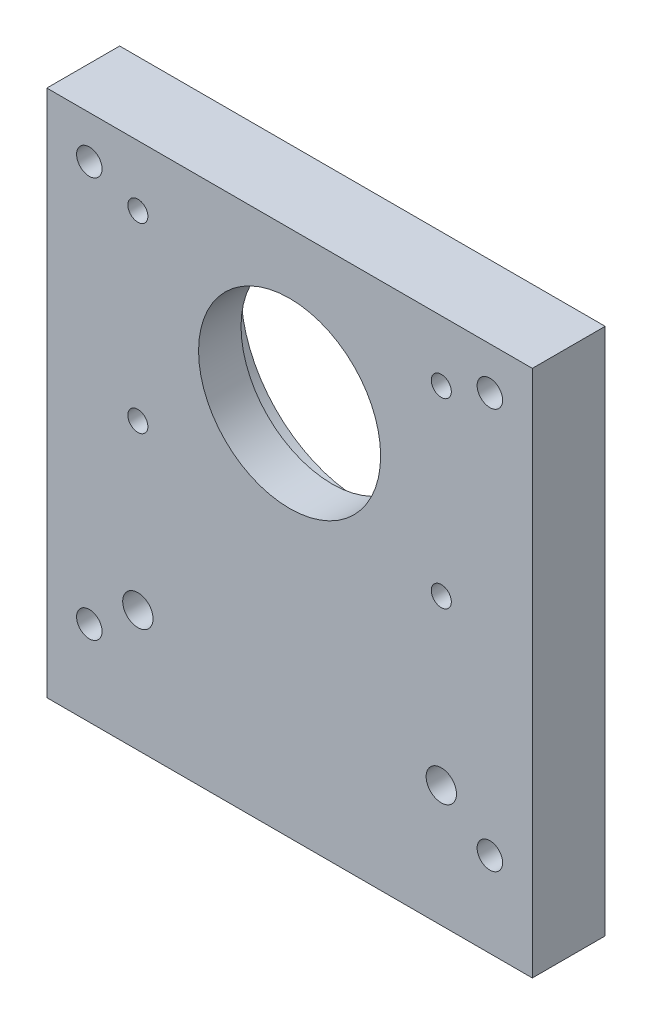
ISO-10303-21;
HEADER;
FILE_DESCRIPTION(('STEP AP214'),'2;1');
FILE_NAME('part.step','',(''),(''),'','','');
FILE_SCHEMA(('AUTOMOTIVE_DESIGN { 1 0 10303 214 1 1 1 1 }'));
ENDSEC;
DATA;
#1=APPLICATION_CONTEXT('core data for automotive mechanical design processes');
#2=APPLICATION_PROTOCOL_DEFINITION('international standard','automotive_design',2000,#1);
#3=PRODUCT_CONTEXT('',#1,'mechanical');
#4=PRODUCT('Part','Part','',(#3));
#5=PRODUCT_RELATED_PRODUCT_CATEGORY('part','',(#4));
#6=PRODUCT_DEFINITION_FORMATION('','',#4);
#7=PRODUCT_DEFINITION_CONTEXT('part definition',#1,'design');
#8=PRODUCT_DEFINITION('design','',#6,#7);
#9=PRODUCT_DEFINITION_SHAPE('','',#8);
#10=(LENGTH_UNIT() NAMED_UNIT(*) SI_UNIT(.MILLI.,.METRE.));
#11=(NAMED_UNIT(*) PLANE_ANGLE_UNIT() SI_UNIT($,.RADIAN.));
#12=(NAMED_UNIT(*) SI_UNIT($,.STERADIAN.) SOLID_ANGLE_UNIT());
#13=UNCERTAINTY_MEASURE_WITH_UNIT(LENGTH_MEASURE(1.E-05),#10,'distance_accuracy_value','');
#14=(GEOMETRIC_REPRESENTATION_CONTEXT(3) GLOBAL_UNCERTAINTY_ASSIGNED_CONTEXT((#13)) GLOBAL_UNIT_ASSIGNED_CONTEXT((#10,
#11,#12)) REPRESENTATION_CONTEXT('',''));
#15=CARTESIAN_POINT('',(0.,0.,0.));
#16=DIRECTION('',(0.,0.,1.));
#17=DIRECTION('',(1.,0.,0.));
#18=AXIS2_PLACEMENT_3D('',#15,#16,#17);
#19=CARTESIAN_POINT('',(40.,61.9999999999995,12.));
#20=DIRECTION('',(0.,0.,-1.));
#21=DIRECTION('',(-1.,0.,0.));
#22=AXIS2_PLACEMENT_3D('',#19,#20,#21);
#23=CYLINDRICAL_SURFACE('',#22,15.);
#24=CARTESIAN_POINT('',(40.,61.9999999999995,12.));
#25=DIRECTION('',(0.,0.,1.));
#26=DIRECTION('',(1.,0.,0.));
#27=AXIS2_PLACEMENT_3D('',#24,#25,#26);
#28=CIRCLE('',#27,15.);
#29=CARTESIAN_POINT('',(55.,61.9999999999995,12.));
#30=VERTEX_POINT('',#29);
#31=EDGE_CURVE('E123',#30,#30,#28,.T.);
#32=ORIENTED_EDGE('',*,*,#31,.T.);
#33=EDGE_LOOP('',(#32));
#34=FACE_BOUND('',#33,.T.);
#35=CARTESIAN_POINT('',(40.,61.9999999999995,5.));
#36=DIRECTION('',(0.,0.,-1.));
#37=DIRECTION('',(-1.,0.,0.));
#38=AXIS2_PLACEMENT_3D('',#35,#36,#37);
#39=CIRCLE('',#38,15.);
#40=CARTESIAN_POINT('',(25.,61.9999999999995,5.));
#41=VERTEX_POINT('',#40);
#42=EDGE_CURVE('E36',#41,#41,#39,.T.);
#43=ORIENTED_EDGE('',*,*,#42,.T.);
#44=EDGE_LOOP('',(#43));
#45=FACE_BOUND('',#44,.T.);
#46=ADVANCED_FACE('F32',(#34,#45),#23,.F.);
#47=CARTESIAN_POINT('',(0.,0.,12.));
#48=DIRECTION('',(0.,0.,1.));
#49=DIRECTION('',(1.,0.,0.));
#50=AXIS2_PLACEMENT_3D('',#47,#48,#49);
#51=PLANE('',#50);
#52=CARTESIAN_POINT('',(7.,13.9999999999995,12.));
#53=DIRECTION('',(0.,0.,1.));
#54=DIRECTION('',(1.,0.,0.));
#55=AXIS2_PLACEMENT_3D('',#52,#53,#54);
#56=CIRCLE('',#55,2.1);
#57=CARTESIAN_POINT('',(9.1,13.9999999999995,12.));
#58=VERTEX_POINT('',#57);
#59=EDGE_CURVE('E162',#58,#58,#56,.T.);
#60=ORIENTED_EDGE('',*,*,#59,.F.);
#61=EDGE_LOOP('',(#60));
#62=FACE_BOUND('',#61,.T.);
#63=CARTESIAN_POINT('',(73.,13.9999999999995,12.));
#64=DIRECTION('',(0.,0.,1.));
#65=DIRECTION('',(1.,0.,0.));
#66=AXIS2_PLACEMENT_3D('',#63,#64,#65);
#67=CIRCLE('',#66,2.1);
#68=CARTESIAN_POINT('',(75.1,13.9999999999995,12.));
#69=VERTEX_POINT('',#68);
#70=EDGE_CURVE('E150',#69,#69,#67,.T.);
#71=ORIENTED_EDGE('',*,*,#70,.F.);
#72=EDGE_LOOP('',(#71));
#73=FACE_BOUND('',#72,.T.);
#74=CARTESIAN_POINT('',(15.0000000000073,76.9999999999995,12.));
#75=DIRECTION('',(0.,0.,1.));
#76=DIRECTION('',(1.,0.,0.));
#77=AXIS2_PLACEMENT_3D('',#74,#75,#76);
#78=CIRCLE('',#77,1.65);
#79=CARTESIAN_POINT('',(16.6500000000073,76.9999999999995,12.));
#80=VERTEX_POINT('',#79);
#81=EDGE_CURVE('E138',#80,#80,#78,.T.);
#82=ORIENTED_EDGE('',*,*,#81,.F.);
#83=EDGE_LOOP('',(#82));
#84=FACE_BOUND('',#83,.T.);
#85=CARTESIAN_POINT('',(65.0000000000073,46.9999999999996,12.));
#86=DIRECTION('',(0.,0.,1.));
#87=DIRECTION('',(1.,0.,0.));
#88=AXIS2_PLACEMENT_3D('',#85,#86,#87);
#89=CIRCLE('',#88,1.65);
#90=CARTESIAN_POINT('',(66.6500000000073,46.9999999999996,12.));
#91=VERTEX_POINT('',#90);
#92=EDGE_CURVE('E128',#91,#91,#89,.T.);
#93=ORIENTED_EDGE('',*,*,#92,.F.);
#94=EDGE_LOOP('',(#93));
#95=FACE_BOUND('',#94,.T.);
#96=CARTESIAN_POINT('',(15.,19.9999999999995,12.));
#97=DIRECTION('',(0.,0.,1.));
#98=DIRECTION('',(1.,0.,0.));
#99=AXIS2_PLACEMENT_3D('',#96,#97,#98);
#100=CIRCLE('',#99,2.5);
#101=CARTESIAN_POINT('',(17.5,19.9999999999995,12.));
#102=VERTEX_POINT('',#101);
#103=EDGE_CURVE('E117',#102,#102,#100,.T.);
#104=ORIENTED_EDGE('',*,*,#103,.F.);
#105=EDGE_LOOP('',(#104));
#106=FACE_BOUND('',#105,.T.);
#107=DIRECTION('',(0.,-1.,0.));
#108=VECTOR('',#107,1.);
#109=CARTESIAN_POINT('',(0.,87.,12.));
#110=LINE('',#109,#108);
#111=CARTESIAN_POINT('',(0.,87.,12.));
#112=VERTEX_POINT('',#111);
#113=CARTESIAN_POINT('',(0.,0.,12.));
#114=VERTEX_POINT('',#113);
#115=EDGE_CURVE('E86',#112,#114,#110,.T.);
#116=ORIENTED_EDGE('',*,*,#115,.T.);
#117=DIRECTION('',(1.,0.,0.));
#118=VECTOR('',#117,1.);
#119=CARTESIAN_POINT('',(0.,0.,12.));
#120=LINE('',#119,#118);
#121=CARTESIAN_POINT('',(80.,0.,12.));
#122=VERTEX_POINT('',#121);
#123=EDGE_CURVE('E80',#114,#122,#120,.T.);
#124=ORIENTED_EDGE('',*,*,#123,.T.);
#125=DIRECTION('',(0.,1.,0.));
#126=VECTOR('',#125,1.);
#127=CARTESIAN_POINT('',(80.,87.,12.));
#128=LINE('',#127,#126);
#129=CARTESIAN_POINT('',(80.,87.,12.));
#130=VERTEX_POINT('',#129);
#131=EDGE_CURVE('E84',#122,#130,#128,.T.);
#132=ORIENTED_EDGE('',*,*,#131,.T.);
#133=DIRECTION('',(-1.,0.,0.));
#134=VECTOR('',#133,1.);
#135=CARTESIAN_POINT('',(0.,87.,12.));
#136=LINE('',#135,#134);
#137=EDGE_CURVE('E50',#130,#112,#136,.T.);
#138=ORIENTED_EDGE('',*,*,#137,.T.);
#139=EDGE_LOOP('',(#116,#124,#132,#138));
#140=FACE_BOUND('',#139,.T.);
#141=CARTESIAN_POINT('',(65.,20.0000000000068,12.));
#142=DIRECTION('',(0.,0.,1.));
#143=DIRECTION('',(1.,0.,0.));
#144=AXIS2_PLACEMENT_3D('',#141,#142,#143);
#145=CIRCLE('',#144,2.5);
#146=CARTESIAN_POINT('',(67.5,20.0000000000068,12.));
#147=VERTEX_POINT('',#146);
#148=EDGE_CURVE('E102',#147,#147,#145,.T.);
#149=ORIENTED_EDGE('',*,*,#148,.F.);
#150=EDGE_LOOP('',(#149));
#151=FACE_BOUND('',#150,.T.);
#152=ORIENTED_EDGE('',*,*,#31,.F.);
#153=EDGE_LOOP('',(#152));
#154=FACE_BOUND('',#153,.T.);
#155=CARTESIAN_POINT('',(65.0000000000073,76.9999999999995,12.));
#156=DIRECTION('',(0.,0.,1.));
#157=DIRECTION('',(1.,0.,0.));
#158=AXIS2_PLACEMENT_3D('',#155,#156,#157);
#159=CIRCLE('',#158,1.65);
#160=CARTESIAN_POINT('',(66.6500000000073,76.9999999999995,12.));
#161=VERTEX_POINT('',#160);
#162=EDGE_CURVE('E132',#161,#161,#159,.T.);
#163=ORIENTED_EDGE('',*,*,#162,.F.);
#164=EDGE_LOOP('',(#163));
#165=FACE_BOUND('',#164,.T.);
#166=CARTESIAN_POINT('',(15.0000000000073,46.9999999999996,12.));
#167=DIRECTION('',(0.,0.,1.));
#168=DIRECTION('',(1.,0.,0.));
#169=AXIS2_PLACEMENT_3D('',#166,#167,#168);
#170=CIRCLE('',#169,1.65);
#171=CARTESIAN_POINT('',(16.6500000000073,46.9999999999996,12.));
#172=VERTEX_POINT('',#171);
#173=EDGE_CURVE('E144',#172,#172,#170,.T.);
#174=ORIENTED_EDGE('',*,*,#173,.F.);
#175=EDGE_LOOP('',(#174));
#176=FACE_BOUND('',#175,.T.);
#177=CARTESIAN_POINT('',(73.0000000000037,79.9999999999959,12.));
#178=DIRECTION('',(0.,0.,1.));
#179=DIRECTION('',(1.,0.,0.));
#180=AXIS2_PLACEMENT_3D('',#177,#178,#179);
#181=CIRCLE('',#180,2.1);
#182=CARTESIAN_POINT('',(75.1000000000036,79.9999999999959,12.));
#183=VERTEX_POINT('',#182);
#184=EDGE_CURVE('E156',#183,#183,#181,.T.);
#185=ORIENTED_EDGE('',*,*,#184,.F.);
#186=EDGE_LOOP('',(#185));
#187=FACE_BOUND('',#186,.T.);
#188=CARTESIAN_POINT('',(7.,79.9999999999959,12.));
#189=DIRECTION('',(0.,0.,1.));
#190=DIRECTION('',(1.,0.,0.));
#191=AXIS2_PLACEMENT_3D('',#188,#189,#190);
#192=CIRCLE('',#191,2.1);
#193=CARTESIAN_POINT('',(9.1,79.9999999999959,12.));
#194=VERTEX_POINT('',#193);
#195=EDGE_CURVE('E168',#194,#194,#192,.T.);
#196=ORIENTED_EDGE('',*,*,#195,.F.);
#197=EDGE_LOOP('',(#196));
#198=FACE_BOUND('',#197,.T.);
#199=ADVANCED_FACE('F81',(#62,#73,#84,#95,#106,#140,#151,#154,#165,#176,#187,#198),#51,.T.);
#200=CARTESIAN_POINT('',(0.,0.,0.));
#201=DIRECTION('',(0.,0.,1.));
#202=DIRECTION('',(1.,0.,0.));
#203=AXIS2_PLACEMENT_3D('',#200,#201,#202);
#204=PLANE('',#203);
#205=CARTESIAN_POINT('',(40.,61.9999999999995,0.));
#206=DIRECTION('',(0.,0.,-1.));
#207=DIRECTION('',(-1.,0.,0.));
#208=AXIS2_PLACEMENT_3D('',#205,#206,#207);
#209=CIRCLE('',#208,20.);
#210=CARTESIAN_POINT('',(20.,61.9999999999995,0.));
#211=VERTEX_POINT('',#210);
#212=EDGE_CURVE('E176',#211,#211,#209,.T.);
#213=ORIENTED_EDGE('',*,*,#212,.F.);
#214=EDGE_LOOP('',(#213));
#215=FACE_BOUND('',#214,.T.);
#216=CARTESIAN_POINT('',(7.,13.9999999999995,0.));
#217=DIRECTION('',(0.,0.,1.));
#218=DIRECTION('',(1.,0.,0.));
#219=AXIS2_PLACEMENT_3D('',#216,#217,#218);
#220=CIRCLE('',#219,2.1);
#221=CARTESIAN_POINT('',(9.1,13.9999999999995,0.));
#222=VERTEX_POINT('',#221);
#223=EDGE_CURVE('E165',#222,#222,#220,.T.);
#224=ORIENTED_EDGE('',*,*,#223,.T.);
#225=EDGE_LOOP('',(#224));
#226=FACE_BOUND('',#225,.T.);
#227=CARTESIAN_POINT('',(73.,13.9999999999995,0.));
#228=DIRECTION('',(0.,0.,1.));
#229=DIRECTION('',(1.,0.,0.));
#230=AXIS2_PLACEMENT_3D('',#227,#228,#229);
#231=CIRCLE('',#230,2.1);
#232=CARTESIAN_POINT('',(75.1,13.9999999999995,0.));
#233=VERTEX_POINT('',#232);
#234=EDGE_CURVE('E153',#233,#233,#231,.T.);
#235=ORIENTED_EDGE('',*,*,#234,.T.);
#236=EDGE_LOOP('',(#235));
#237=FACE_BOUND('',#236,.T.);
#238=CARTESIAN_POINT('',(15.0000000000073,76.9999999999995,0.));
#239=DIRECTION('',(0.,0.,1.));
#240=DIRECTION('',(1.,0.,0.));
#241=AXIS2_PLACEMENT_3D('',#238,#239,#240);
#242=CIRCLE('',#241,1.65);
#243=CARTESIAN_POINT('',(16.6500000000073,76.9999999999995,0.));
#244=VERTEX_POINT('',#243);
#245=EDGE_CURVE('E141',#244,#244,#242,.T.);
#246=ORIENTED_EDGE('',*,*,#245,.T.);
#247=EDGE_LOOP('',(#246));
#248=FACE_BOUND('',#247,.T.);
#249=CARTESIAN_POINT('',(65.0000000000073,46.9999999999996,0.));
#250=DIRECTION('',(0.,0.,1.));
#251=DIRECTION('',(1.,0.,0.));
#252=AXIS2_PLACEMENT_3D('',#249,#250,#251);
#253=CIRCLE('',#252,1.65);
#254=CARTESIAN_POINT('',(66.6500000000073,46.9999999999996,0.));
#255=VERTEX_POINT('',#254);
#256=EDGE_CURVE('E129',#255,#255,#253,.T.);
#257=ORIENTED_EDGE('',*,*,#256,.T.);
#258=EDGE_LOOP('',(#257));
#259=FACE_BOUND('',#258,.T.);
#260=CARTESIAN_POINT('',(15.,19.9999999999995,0.));
#261=DIRECTION('',(0.,0.,1.));
#262=DIRECTION('',(1.,0.,0.));
#263=AXIS2_PLACEMENT_3D('',#260,#261,#262);
#264=CIRCLE('',#263,2.5);
#265=CARTESIAN_POINT('',(17.5,19.9999999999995,0.));
#266=VERTEX_POINT('',#265);
#267=EDGE_CURVE('E120',#266,#266,#264,.T.);
#268=ORIENTED_EDGE('',*,*,#267,.T.);
#269=EDGE_LOOP('',(#268));
#270=FACE_BOUND('',#269,.T.);
#271=DIRECTION('',(0.,-1.,0.));
#272=VECTOR('',#271,1.);
#273=CARTESIAN_POINT('',(0.,87.,0.));
#274=LINE('',#273,#272);
#275=CARTESIAN_POINT('',(0.,87.,0.));
#276=VERTEX_POINT('',#275);
#277=CARTESIAN_POINT('',(0.,0.,0.));
#278=VERTEX_POINT('',#277);
#279=EDGE_CURVE('E99',#276,#278,#274,.T.);
#280=ORIENTED_EDGE('',*,*,#279,.F.);
#281=DIRECTION('',(-1.,0.,0.));
#282=VECTOR('',#281,1.);
#283=CARTESIAN_POINT('',(0.,87.,0.));
#284=LINE('',#283,#282);
#285=CARTESIAN_POINT('',(80.,87.,0.));
#286=VERTEX_POINT('',#285);
#287=EDGE_CURVE('E73',#286,#276,#284,.T.);
#288=ORIENTED_EDGE('',*,*,#287,.F.);
#289=DIRECTION('',(0.,1.,0.));
#290=VECTOR('',#289,1.);
#291=CARTESIAN_POINT('',(80.,87.,0.));
#292=LINE('',#291,#290);
#293=CARTESIAN_POINT('',(80.,0.,0.));
#294=VERTEX_POINT('',#293);
#295=EDGE_CURVE('E67',#294,#286,#292,.T.);
#296=ORIENTED_EDGE('',*,*,#295,.F.);
#297=DIRECTION('',(1.,0.,0.));
#298=VECTOR('',#297,1.);
#299=CARTESIAN_POINT('',(0.,0.,0.));
#300=LINE('',#299,#298);
#301=EDGE_CURVE('E90',#278,#294,#300,.T.);
#302=ORIENTED_EDGE('',*,*,#301,.F.);
#303=EDGE_LOOP('',(#280,#288,#296,#302));
#304=FACE_BOUND('',#303,.T.);
#305=CARTESIAN_POINT('',(65.,20.0000000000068,0.));
#306=DIRECTION('',(0.,0.,1.));
#307=DIRECTION('',(1.,0.,0.));
#308=AXIS2_PLACEMENT_3D('',#305,#306,#307);
#309=CIRCLE('',#308,2.5);
#310=CARTESIAN_POINT('',(67.5,20.0000000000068,0.));
#311=VERTEX_POINT('',#310);
#312=EDGE_CURVE('E114',#311,#311,#309,.T.);
#313=ORIENTED_EDGE('',*,*,#312,.T.);
#314=EDGE_LOOP('',(#313));
#315=FACE_BOUND('',#314,.T.);
#316=CARTESIAN_POINT('',(65.0000000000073,76.9999999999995,0.));
#317=DIRECTION('',(0.,0.,1.));
#318=DIRECTION('',(1.,0.,0.));
#319=AXIS2_PLACEMENT_3D('',#316,#317,#318);
#320=CIRCLE('',#319,1.65);
#321=CARTESIAN_POINT('',(66.6500000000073,76.9999999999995,0.));
#322=VERTEX_POINT('',#321);
#323=EDGE_CURVE('E135',#322,#322,#320,.T.);
#324=ORIENTED_EDGE('',*,*,#323,.T.);
#325=EDGE_LOOP('',(#324));
#326=FACE_BOUND('',#325,.T.);
#327=CARTESIAN_POINT('',(15.0000000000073,46.9999999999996,0.));
#328=DIRECTION('',(0.,0.,1.));
#329=DIRECTION('',(1.,0.,0.));
#330=AXIS2_PLACEMENT_3D('',#327,#328,#329);
#331=CIRCLE('',#330,1.65);
#332=CARTESIAN_POINT('',(16.6500000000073,46.9999999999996,0.));
#333=VERTEX_POINT('',#332);
#334=EDGE_CURVE('E147',#333,#333,#331,.T.);
#335=ORIENTED_EDGE('',*,*,#334,.T.);
#336=EDGE_LOOP('',(#335));
#337=FACE_BOUND('',#336,.T.);
#338=CARTESIAN_POINT('',(73.0000000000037,79.9999999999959,0.));
#339=DIRECTION('',(0.,0.,1.));
#340=DIRECTION('',(1.,0.,0.));
#341=AXIS2_PLACEMENT_3D('',#338,#339,#340);
#342=CIRCLE('',#341,2.1);
#343=CARTESIAN_POINT('',(75.1000000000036,79.9999999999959,0.));
#344=VERTEX_POINT('',#343);
#345=EDGE_CURVE('E159',#344,#344,#342,.T.);
#346=ORIENTED_EDGE('',*,*,#345,.T.);
#347=EDGE_LOOP('',(#346));
#348=FACE_BOUND('',#347,.T.);
#349=CARTESIAN_POINT('',(7.,79.9999999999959,0.));
#350=DIRECTION('',(0.,0.,1.));
#351=DIRECTION('',(1.,0.,0.));
#352=AXIS2_PLACEMENT_3D('',#349,#350,#351);
#353=CIRCLE('',#352,2.1);
#354=CARTESIAN_POINT('',(9.1,79.9999999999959,0.));
#355=VERTEX_POINT('',#354);
#356=EDGE_CURVE('E171',#355,#355,#353,.T.);
#357=ORIENTED_EDGE('',*,*,#356,.T.);
#358=EDGE_LOOP('',(#357));
#359=FACE_BOUND('',#358,.T.);
#360=ADVANCED_FACE('F110',(#215,#226,#237,#248,#259,#270,#304,#315,#326,#337,#348,#359),#204,.F.);
#361=CARTESIAN_POINT('',(0.,87.,12.));
#362=DIRECTION('',(1.,0.,0.));
#363=DIRECTION('',(0.,0.,-1.));
#364=AXIS2_PLACEMENT_3D('',#361,#362,#363);
#365=PLANE('',#364);
#366=ORIENTED_EDGE('',*,*,#279,.T.);
#367=DIRECTION('',(0.,0.,-1.));
#368=VECTOR('',#367,1.);
#369=CARTESIAN_POINT('',(0.,0.,12.));
#370=LINE('',#369,#368);
#371=EDGE_CURVE('E11',#114,#278,#370,.T.);
#372=ORIENTED_EDGE('',*,*,#371,.F.);
#373=ORIENTED_EDGE('',*,*,#115,.F.);
#374=DIRECTION('',(0.,0.,-1.));
#375=VECTOR('',#374,1.);
#376=CARTESIAN_POINT('',(0.,87.,12.));
#377=LINE('',#376,#375);
#378=EDGE_CURVE('E95',#112,#276,#377,.T.);
#379=ORIENTED_EDGE('',*,*,#378,.T.);
#380=EDGE_LOOP('',(#366,#372,#373,#379));
#381=FACE_BOUND('',#380,.T.);
#382=ADVANCED_FACE('F34',(#381),#365,.F.);
#383=CARTESIAN_POINT('',(0.,0.,12.));
#384=DIRECTION('',(0.,1.,0.));
#385=DIRECTION('',(0.,0.,1.));
#386=AXIS2_PLACEMENT_3D('',#383,#384,#385);
#387=PLANE('',#386);
#388=ORIENTED_EDGE('',*,*,#301,.T.);
#389=DIRECTION('',(0.,0.,-1.));
#390=VECTOR('',#389,1.);
#391=CARTESIAN_POINT('',(80.,0.,12.));
#392=LINE('',#391,#390);
#393=EDGE_CURVE('E42',#122,#294,#392,.T.);
#394=ORIENTED_EDGE('',*,*,#393,.F.);
#395=ORIENTED_EDGE('',*,*,#123,.F.);
#396=ORIENTED_EDGE('',*,*,#371,.T.);
#397=EDGE_LOOP('',(#388,#394,#395,#396));
#398=FACE_BOUND('',#397,.T.);
#399=ADVANCED_FACE('F89',(#398),#387,.F.);
#400=CARTESIAN_POINT('',(80.,87.,12.));
#401=DIRECTION('',(-1.,0.,0.));
#402=DIRECTION('',(0.,0.,1.));
#403=AXIS2_PLACEMENT_3D('',#400,#401,#402);
#404=PLANE('',#403);
#405=ORIENTED_EDGE('',*,*,#295,.T.);
#406=DIRECTION('',(0.,0.,-1.));
#407=VECTOR('',#406,1.);
#408=CARTESIAN_POINT('',(80.,87.,12.));
#409=LINE('',#408,#407);
#410=EDGE_CURVE('E91',#130,#286,#409,.T.);
#411=ORIENTED_EDGE('',*,*,#410,.F.);
#412=ORIENTED_EDGE('',*,*,#131,.F.);
#413=ORIENTED_EDGE('',*,*,#393,.T.);
#414=EDGE_LOOP('',(#405,#411,#412,#413));
#415=FACE_BOUND('',#414,.T.);
#416=ADVANCED_FACE('F93',(#415),#404,.F.);
#417=CARTESIAN_POINT('',(0.,87.,12.));
#418=DIRECTION('',(0.,-1.,0.));
#419=DIRECTION('',(0.,0.,-1.));
#420=AXIS2_PLACEMENT_3D('',#417,#418,#419);
#421=PLANE('',#420);
#422=ORIENTED_EDGE('',*,*,#287,.T.);
#423=ORIENTED_EDGE('',*,*,#378,.F.);
#424=ORIENTED_EDGE('',*,*,#137,.F.);
#425=ORIENTED_EDGE('',*,*,#410,.T.);
#426=EDGE_LOOP('',(#422,#423,#424,#425));
#427=FACE_BOUND('',#426,.T.);
#428=ADVANCED_FACE('F107',(#427),#421,.F.);
#429=CARTESIAN_POINT('',(65.,20.0000000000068,12.));
#430=DIRECTION('',(0.,0.,-1.));
#431=DIRECTION('',(-1.,0.,0.));
#432=AXIS2_PLACEMENT_3D('',#429,#430,#431);
#433=CYLINDRICAL_SURFACE('',#432,2.5);
#434=ORIENTED_EDGE('',*,*,#148,.T.);
#435=EDGE_LOOP('',(#434));
#436=FACE_BOUND('',#435,.T.);
#437=ORIENTED_EDGE('',*,*,#312,.F.);
#438=EDGE_LOOP('',(#437));
#439=FACE_BOUND('',#438,.T.);
#440=ADVANCED_FACE('F212',(#436,#439),#433,.F.);
#441=CARTESIAN_POINT('',(15.,19.9999999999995,12.));
#442=DIRECTION('',(0.,0.,-1.));
#443=DIRECTION('',(-1.,0.,0.));
#444=AXIS2_PLACEMENT_3D('',#441,#442,#443);
#445=CYLINDRICAL_SURFACE('',#444,2.5);
#446=ORIENTED_EDGE('',*,*,#103,.T.);
#447=EDGE_LOOP('',(#446));
#448=FACE_BOUND('',#447,.T.);
#449=ORIENTED_EDGE('',*,*,#267,.F.);
#450=EDGE_LOOP('',(#449));
#451=FACE_BOUND('',#450,.T.);
#452=ADVANCED_FACE('F209',(#448,#451),#445,.F.);
#453=CARTESIAN_POINT('',(65.0000000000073,46.9999999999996,12.));
#454=DIRECTION('',(0.,0.,-1.));
#455=DIRECTION('',(-1.,0.,0.));
#456=AXIS2_PLACEMENT_3D('',#453,#454,#455);
#457=CYLINDRICAL_SURFACE('',#456,1.65);
#458=ORIENTED_EDGE('',*,*,#92,.T.);
#459=EDGE_LOOP('',(#458));
#460=FACE_BOUND('',#459,.T.);
#461=ORIENTED_EDGE('',*,*,#256,.F.);
#462=EDGE_LOOP('',(#461));
#463=FACE_BOUND('',#462,.T.);
#464=ADVANCED_FACE('F207',(#460,#463),#457,.F.);
#465=CARTESIAN_POINT('',(65.0000000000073,76.9999999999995,12.));
#466=DIRECTION('',(0.,0.,-1.));
#467=DIRECTION('',(-1.,0.,0.));
#468=AXIS2_PLACEMENT_3D('',#465,#466,#467);
#469=CYLINDRICAL_SURFACE('',#468,1.65);
#470=ORIENTED_EDGE('',*,*,#162,.T.);
#471=EDGE_LOOP('',(#470));
#472=FACE_BOUND('',#471,.T.);
#473=ORIENTED_EDGE('',*,*,#323,.F.);
#474=EDGE_LOOP('',(#473));
#475=FACE_BOUND('',#474,.T.);
#476=ADVANCED_FACE('F276',(#472,#475),#469,.F.);
#477=CARTESIAN_POINT('',(15.0000000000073,76.9999999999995,12.));
#478=DIRECTION('',(0.,0.,-1.));
#479=DIRECTION('',(-1.,0.,0.));
#480=AXIS2_PLACEMENT_3D('',#477,#478,#479);
#481=CYLINDRICAL_SURFACE('',#480,1.65);
#482=ORIENTED_EDGE('',*,*,#81,.T.);
#483=EDGE_LOOP('',(#482));
#484=FACE_BOUND('',#483,.T.);
#485=ORIENTED_EDGE('',*,*,#245,.F.);
#486=EDGE_LOOP('',(#485));
#487=FACE_BOUND('',#486,.T.);
#488=ADVANCED_FACE('F284',(#484,#487),#481,.F.);
#489=CARTESIAN_POINT('',(15.0000000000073,46.9999999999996,12.));
#490=DIRECTION('',(0.,0.,-1.));
#491=DIRECTION('',(-1.,0.,0.));
#492=AXIS2_PLACEMENT_3D('',#489,#490,#491);
#493=CYLINDRICAL_SURFACE('',#492,1.65);
#494=ORIENTED_EDGE('',*,*,#173,.T.);
#495=EDGE_LOOP('',(#494));
#496=FACE_BOUND('',#495,.T.);
#497=ORIENTED_EDGE('',*,*,#334,.F.);
#498=EDGE_LOOP('',(#497));
#499=FACE_BOUND('',#498,.T.);
#500=ADVANCED_FACE('F292',(#496,#499),#493,.F.);
#501=CARTESIAN_POINT('',(73.,13.9999999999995,12.));
#502=DIRECTION('',(0.,0.,-1.));
#503=DIRECTION('',(-1.,0.,0.));
#504=AXIS2_PLACEMENT_3D('',#501,#502,#503);
#505=CYLINDRICAL_SURFACE('',#504,2.1);
#506=ORIENTED_EDGE('',*,*,#70,.T.);
#507=EDGE_LOOP('',(#506));
#508=FACE_BOUND('',#507,.T.);
#509=ORIENTED_EDGE('',*,*,#234,.F.);
#510=EDGE_LOOP('',(#509));
#511=FACE_BOUND('',#510,.T.);
#512=ADVANCED_FACE('F301',(#508,#511),#505,.F.);
#513=CARTESIAN_POINT('',(73.0000000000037,79.9999999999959,12.));
#514=DIRECTION('',(0.,0.,-1.));
#515=DIRECTION('',(-1.,0.,0.));
#516=AXIS2_PLACEMENT_3D('',#513,#514,#515);
#517=CYLINDRICAL_SURFACE('',#516,2.1);
#518=ORIENTED_EDGE('',*,*,#184,.T.);
#519=EDGE_LOOP('',(#518));
#520=FACE_BOUND('',#519,.T.);
#521=ORIENTED_EDGE('',*,*,#345,.F.);
#522=EDGE_LOOP('',(#521));
#523=FACE_BOUND('',#522,.T.);
#524=ADVANCED_FACE('F310',(#520,#523),#517,.F.);
#525=CARTESIAN_POINT('',(7.,13.9999999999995,12.));
#526=DIRECTION('',(0.,0.,-1.));
#527=DIRECTION('',(-1.,0.,0.));
#528=AXIS2_PLACEMENT_3D('',#525,#526,#527);
#529=CYLINDRICAL_SURFACE('',#528,2.1);
#530=ORIENTED_EDGE('',*,*,#59,.T.);
#531=EDGE_LOOP('',(#530));
#532=FACE_BOUND('',#531,.T.);
#533=ORIENTED_EDGE('',*,*,#223,.F.);
#534=EDGE_LOOP('',(#533));
#535=FACE_BOUND('',#534,.T.);
#536=ADVANCED_FACE('F319',(#532,#535),#529,.F.);
#537=CARTESIAN_POINT('',(7.,79.9999999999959,12.));
#538=DIRECTION('',(0.,0.,-1.));
#539=DIRECTION('',(-1.,0.,0.));
#540=AXIS2_PLACEMENT_3D('',#537,#538,#539);
#541=CYLINDRICAL_SURFACE('',#540,2.1);
#542=ORIENTED_EDGE('',*,*,#195,.T.);
#543=EDGE_LOOP('',(#542));
#544=FACE_BOUND('',#543,.T.);
#545=ORIENTED_EDGE('',*,*,#356,.F.);
#546=EDGE_LOOP('',(#545));
#547=FACE_BOUND('',#546,.T.);
#548=ADVANCED_FACE('F194',(#544,#547),#541,.F.);
#549=CARTESIAN_POINT('',(40.,61.9999999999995,5.));
#550=DIRECTION('',(0.,0.,-1.));
#551=DIRECTION('',(-1.,0.,0.));
#552=AXIS2_PLACEMENT_3D('',#549,#550,#551);
#553=CYLINDRICAL_SURFACE('',#552,20.);
#554=CARTESIAN_POINT('',(40.,61.9999999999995,5.));
#555=DIRECTION('',(0.,0.,-1.));
#556=DIRECTION('',(-1.,0.,0.));
#557=AXIS2_PLACEMENT_3D('',#554,#555,#556);
#558=CIRCLE('',#557,20.);
#559=CARTESIAN_POINT('',(20.,61.9999999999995,5.));
#560=VERTEX_POINT('',#559);
#561=EDGE_CURVE('E179',#560,#560,#558,.T.);
#562=ORIENTED_EDGE('',*,*,#561,.F.);
#563=EDGE_LOOP('',(#562));
#564=FACE_BOUND('',#563,.T.);
#565=ORIENTED_EDGE('',*,*,#212,.T.);
#566=EDGE_LOOP('',(#565));
#567=FACE_BOUND('',#566,.T.);
#568=ADVANCED_FACE('F189',(#564,#567),#553,.F.);
#569=CARTESIAN_POINT('',(40.,61.9999999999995,5.));
#570=DIRECTION('',(0.,0.,-1.));
#571=DIRECTION('',(-1.,0.,0.));
#572=AXIS2_PLACEMENT_3D('',#569,#570,#571);
#573=PLANE('',#572);
#574=ORIENTED_EDGE('',*,*,#42,.F.);
#575=EDGE_LOOP('',(#574));
#576=FACE_BOUND('',#575,.T.);
#577=ORIENTED_EDGE('',*,*,#561,.T.);
#578=EDGE_LOOP('',(#577));
#579=FACE_BOUND('',#578,.T.);
#580=ADVANCED_FACE('F187',(#576,#579),#573,.T.);
#581=CLOSED_SHELL('',(#46,#199,#360,#382,#399,#416,#428,#440,#452,#464,#476,#488,#500,#512,#524,
#536,#548,#568,#580));
#582=MANIFOLD_SOLID_BREP('B2',#581);
#583=ADVANCED_BREP_SHAPE_REPRESENTATION('',(#18,#582),#14);
#584=SHAPE_DEFINITION_REPRESENTATION(#9,#583);
ENDSEC;
END-ISO-10303-21;
